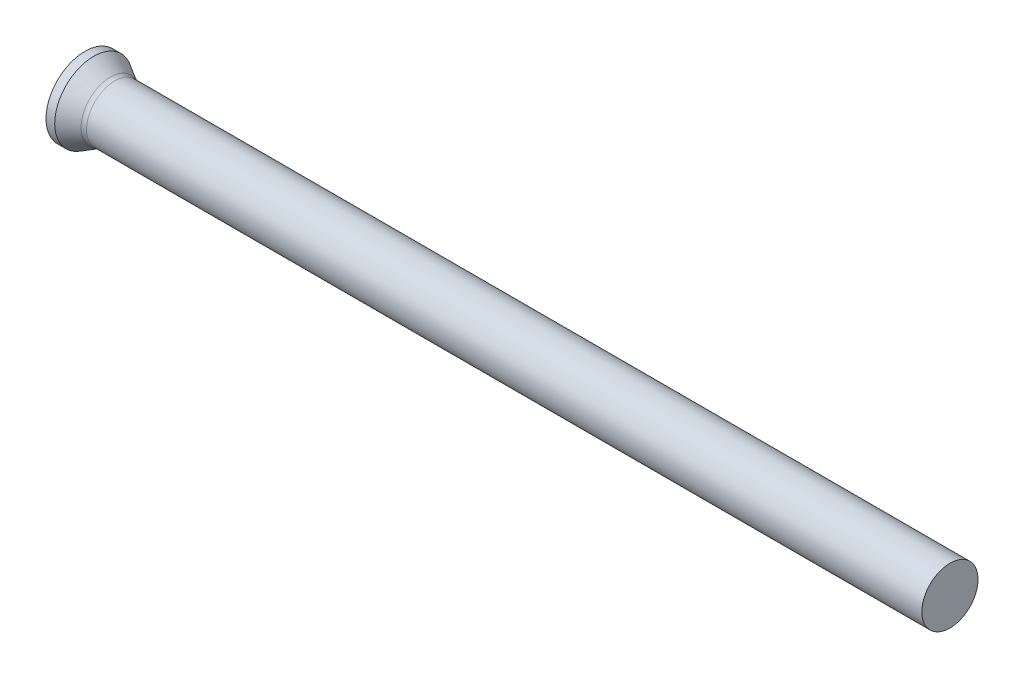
ISO-10303-21;
HEADER;
FILE_DESCRIPTION(('STEP AP214'),'2;1');
FILE_NAME('part.step','',(''),(''),'','','');
FILE_SCHEMA(('AUTOMOTIVE_DESIGN { 1 0 10303 214 1 1 1 1 }'));
ENDSEC;
DATA;
#1=APPLICATION_CONTEXT('core data for automotive mechanical design processes');
#2=APPLICATION_PROTOCOL_DEFINITION('international standard','automotive_design',2000,#1);
#3=PRODUCT_CONTEXT('',#1,'mechanical');
#4=PRODUCT('Part','Part','',(#3));
#5=PRODUCT_RELATED_PRODUCT_CATEGORY('part','',(#4));
#6=PRODUCT_DEFINITION_FORMATION('','',#4);
#7=PRODUCT_DEFINITION_CONTEXT('part definition',#1,'design');
#8=PRODUCT_DEFINITION('design','',#6,#7);
#9=PRODUCT_DEFINITION_SHAPE('','',#8);
#10=(LENGTH_UNIT() NAMED_UNIT(*) SI_UNIT(.MILLI.,.METRE.));
#11=(NAMED_UNIT(*) PLANE_ANGLE_UNIT() SI_UNIT($,.RADIAN.));
#12=(NAMED_UNIT(*) SI_UNIT($,.STERADIAN.) SOLID_ANGLE_UNIT());
#13=UNCERTAINTY_MEASURE_WITH_UNIT(LENGTH_MEASURE(1.E-05),#10,'distance_accuracy_value','');
#14=(GEOMETRIC_REPRESENTATION_CONTEXT(3) GLOBAL_UNCERTAINTY_ASSIGNED_CONTEXT((#13)) GLOBAL_UNIT_ASSIGNED_CONTEXT((#10,
#11,#12)) REPRESENTATION_CONTEXT('',''));
#15=CARTESIAN_POINT('',(0.,0.,0.));
#16=DIRECTION('',(0.,0.,1.));
#17=DIRECTION('',(1.,0.,0.));
#18=AXIS2_PLACEMENT_3D('',#15,#16,#17);
#19=CARTESIAN_POINT('',(0.,0.,0.));
#20=DIRECTION('',(1.,0.,0.));
#21=DIRECTION('',(0.,0.,-1.));
#22=AXIS2_PLACEMENT_3D('',#19,#20,#21);
#23=PLANE('',#22);
#24=CARTESIAN_POINT('',(0.,0.,0.));
#25=DIRECTION('',(-1.,0.,0.));
#26=DIRECTION('',(0.,0.,1.));
#27=AXIS2_PLACEMENT_3D('',#24,#25,#26);
#28=CIRCLE('',#27,4.5);
#29=CARTESIAN_POINT('',(0.,0.,4.5));
#30=VERTEX_POINT('',#29);
#31=EDGE_CURVE('E25',#30,#30,#28,.T.);
#32=ORIENTED_EDGE('',*,*,#31,.T.);
#33=EDGE_LOOP('',(#32));
#34=FACE_BOUND('',#33,.T.);
#35=ADVANCED_FACE('F14',(#34),#23,.F.);
#36=CARTESIAN_POINT('',(0.,0.,0.));
#37=DIRECTION('',(-1.,0.,0.));
#38=DIRECTION('',(0.,0.,1.));
#39=AXIS2_PLACEMENT_3D('',#36,#37,#38);
#40=CYLINDRICAL_SURFACE('',#39,4.5);
#41=ORIENTED_EDGE('',*,*,#31,.F.);
#42=EDGE_LOOP('',(#41));
#43=FACE_BOUND('',#42,.T.);
#44=CARTESIAN_POINT('',(1.00493649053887,0.,0.));
#45=DIRECTION('',(-1.,0.,0.));
#46=DIRECTION('',(0.,0.,1.));
#47=AXIS2_PLACEMENT_3D('',#44,#45,#46);
#48=CIRCLE('',#47,4.5);
#49=CARTESIAN_POINT('',(1.00493649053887,0.,4.5));
#50=VERTEX_POINT('',#49);
#51=EDGE_CURVE('E29',#50,#50,#48,.T.);
#52=ORIENTED_EDGE('',*,*,#51,.T.);
#53=EDGE_LOOP('',(#52));
#54=FACE_BOUND('',#53,.T.);
#55=ADVANCED_FACE('F53',(#43,#54),#40,.T.);
#56=CARTESIAN_POINT('',(3.17,0.,0.));
#57=DIRECTION('',(-1.,0.,0.));
#58=DIRECTION('',(0.,0.,1.));
#59=AXIS2_PLACEMENT_3D('',#56,#57,#58);
#60=CONICAL_SURFACE('',#59,3.25,0.523598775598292);
#61=CARTESIAN_POINT('',(2.93794919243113,0.,0.));
#62=DIRECTION('',(-1.,0.,0.));
#63=DIRECTION('',(0.,0.,1.));
#64=AXIS2_PLACEMENT_3D('',#61,#62,#63);
#65=CIRCLE('',#64,3.38397459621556);
#66=CARTESIAN_POINT('',(2.93794919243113,0.,3.38397459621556));
#67=VERTEX_POINT('',#66);
#68=EDGE_CURVE('E21',#67,#67,#65,.T.);
#69=ORIENTED_EDGE('',*,*,#68,.T.);
#70=EDGE_LOOP('',(#69));
#71=FACE_BOUND('',#70,.T.);
#72=ORIENTED_EDGE('',*,*,#51,.F.);
#73=EDGE_LOOP('',(#72));
#74=FACE_BOUND('',#73,.T.);
#75=ADVANCED_FACE('F50',(#71,#74),#60,.T.);
#76=CARTESIAN_POINT('',(0.,0.,0.));
#77=DIRECTION('',(-1.,0.,0.));
#78=DIRECTION('',(0.,0.,1.));
#79=AXIS2_PLACEMENT_3D('',#76,#77,#78);
#80=CYLINDRICAL_SURFACE('',#79,3.25);
#81=CARTESIAN_POINT('',(3.43794919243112,0.,0.));
#82=DIRECTION('',(-1.,0.,0.));
#83=DIRECTION('',(0.,0.,1.));
#84=AXIS2_PLACEMENT_3D('',#81,#82,#83);
#85=CIRCLE('',#84,3.25);
#86=CARTESIAN_POINT('',(3.43794919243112,0.,3.25));
#87=VERTEX_POINT('',#86);
#88=EDGE_CURVE('E9',#87,#87,#85,.F.);
#89=ORIENTED_EDGE('',*,*,#88,.T.);
#90=EDGE_LOOP('',(#89));
#91=FACE_BOUND('',#90,.T.);
#92=CARTESIAN_POINT('',(100.,0.,0.));
#93=DIRECTION('',(-1.,0.,0.));
#94=DIRECTION('',(0.,0.,1.));
#95=AXIS2_PLACEMENT_3D('',#92,#93,#94);
#96=CIRCLE('',#95,3.25);
#97=CARTESIAN_POINT('',(100.,0.,3.25));
#98=VERTEX_POINT('',#97);
#99=EDGE_CURVE('E34',#98,#98,#96,.T.);
#100=ORIENTED_EDGE('',*,*,#99,.T.);
#101=EDGE_LOOP('',(#100));
#102=FACE_BOUND('',#101,.T.);
#103=ADVANCED_FACE('F38',(#91,#102),#80,.T.);
#104=CARTESIAN_POINT('',(100.,3.25,0.));
#105=DIRECTION('',(-1.,0.,0.));
#106=DIRECTION('',(0.,0.,1.));
#107=AXIS2_PLACEMENT_3D('',#104,#105,#106);
#108=PLANE('',#107);
#109=ORIENTED_EDGE('',*,*,#99,.F.);
#110=EDGE_LOOP('',(#109));
#111=FACE_BOUND('',#110,.T.);
#112=ADVANCED_FACE('F40',(#111),#108,.F.);
#113=CARTESIAN_POINT('',(3.43794919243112,0.,0.));
#114=DIRECTION('',(-1.,0.,0.));
#115=DIRECTION('',(0.,0.,1.));
#116=AXIS2_PLACEMENT_3D('',#113,#114,#115);
#117=TOROIDAL_SURFACE('',#116,4.25,1.);
#118=ORIENTED_EDGE('',*,*,#88,.F.);
#119=EDGE_LOOP('',(#118));
#120=FACE_BOUND('',#119,.T.);
#121=ORIENTED_EDGE('',*,*,#68,.F.);
#122=EDGE_LOOP('',(#121));
#123=FACE_BOUND('',#122,.T.);
#124=ADVANCED_FACE('F16',(#120,#123),#117,.F.);
#125=CLOSED_SHELL('',(#35,#55,#75,#103,#112,#124));
#126=MANIFOLD_SOLID_BREP('B1',#125);
#127=ADVANCED_BREP_SHAPE_REPRESENTATION('',(#18,#126),#14);
#128=SHAPE_DEFINITION_REPRESENTATION(#9,#127);
ENDSEC;
END-ISO-10303-21;
